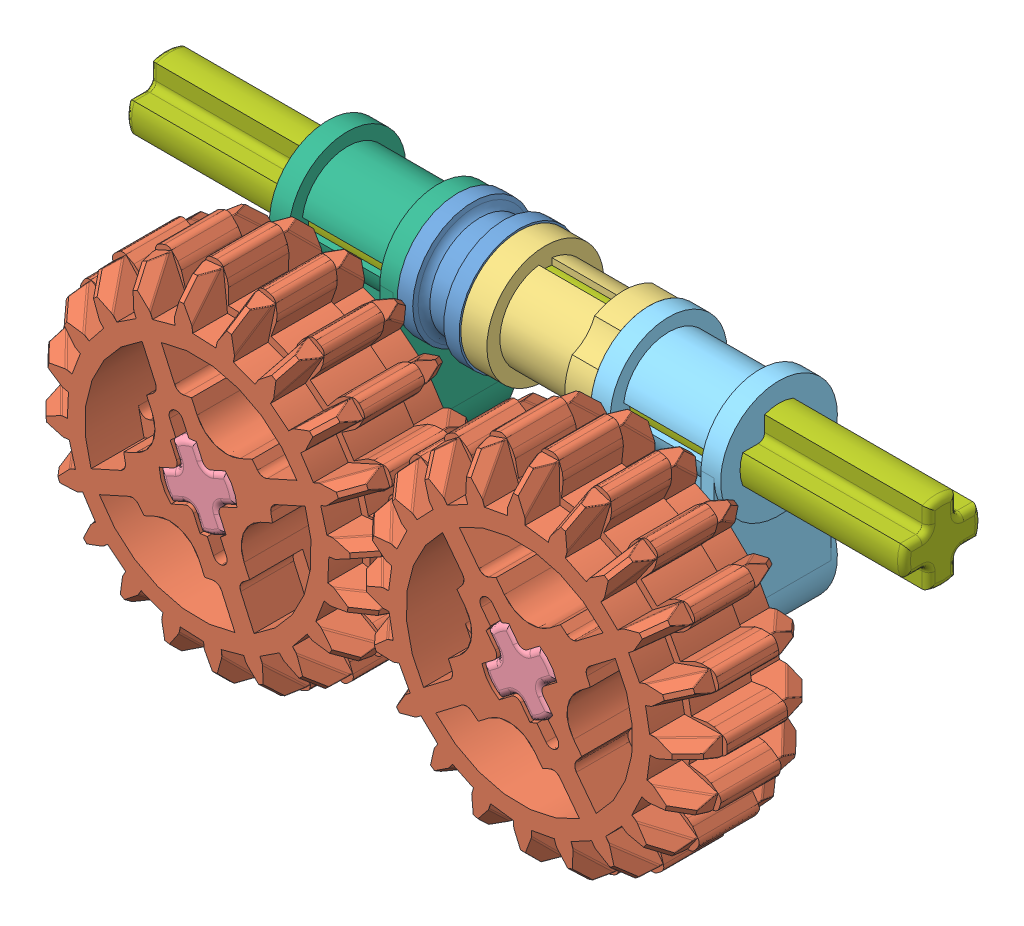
SolidWorks assembly 13.1.SLDASM, configuration Default (file format 12000). Lengths in mm.
Overall size (48.86 29.9 16.06).
9 component instances, 7 part files, 23 mates.
Components (placement in the parent):
- 32123 Bush 0.5 Smooth-1: 32123 Bush 0.5 Smooth.SLDPRT [Default] at (49.0234 -15.3474 45.225) x (1 0 0) z (0 1 0) size (4 7.44 7.44)
- 32269 Gear 20 Tooth Double Bevel Gray-1: 32269 Gear 20 Tooth Double Bevel Gray.SLDPRT [Default] at (62.9234 -23.3474 53.225) x (0.794952 0.606673 0) z (0.606673 -0.794952 0) size (21.33 8.11 21.33)
- 3713 Bush-1: 3713 Bush.SLDPRT [Default] at (54.9234 -15.3474 45.225) x (0 0 1) z (0 1 0) size (7.2 8 7.2)
- 3749 Axle Pin without Friction Ridges Lengthwise-1: 3749 Axle Pin without Friction Ridges Lengthwise.SLDPRT [Default] at (62.9234 -23.3474 49.225) x (0.606673 -0.794952 0) z (-0.794952 -0.606673 0) size (6 16 6)
- 3749 Axle Pin without Friction Ridges Lengthwise-2: 3749 Axle Pin without Friction Ridges Lengthwise.SLDPRT [Default] at (43.1234 -23.3474 49.225) x (-0.411303 0.911499 0) z (0.911499 0.411303 0) size (6 16 6)
- 32269 Gear 20 Tooth Double Bevel Gray-2: 32269 Gear 20 Tooth Double Bevel Gray.SLDPRT [Default] at (43.1234 -23.3474 53.225) x (0.911499 0.411303 0) z (0.411303 -0.911499 0) size (21.33 8.11 21.33)
- 6536 Axle and Pin Connector Perpendicular Blue-2: 6536 Axle and Pin Connector Perpendicular Blue.SLDPRT [Default] at (62.9234 -15.3474 45.225) x (0 1 0) z (0 0 -1) size (15.2 8 8)
- 6536 Axle and Pin Connector Perpendicular Red-2: 6536 Axle and Pin Connector Perpendicular Red.SLDPRT [Default] at (43.1234 -15.3474 45.225) x (0 1 0) z (0 0 -1) size (15.2 8 8)
- 3706 Axle 6-2: 3706 Axle 6.SLDPRT [Default] at (29.0234 -15.3474 45.225) x (0 0 -1) z (0 -1 0) size (4.8 48 4.8)
Mates (geometry in assembly coordinates):
- Concentric2: concentric anti-aligned: cylinder of 32123 Bush 0.5 Smooth-1 through (47.0071 -15.3474 45.225) axis (1 0 0) radius 2.4; cylinder of 3706 Axle 6-2 through (77.0234 -15.3474 45.225) axis (-1 0 0) radius 2.4
- Concentric3: concentric anti-aligned: cylinder of 3713 Bush-1 through (50.9234 -15.3474 45.225) axis (1 0 0) radius 2.4; cylinder of 3706 Axle 6-2 through (77.0234 -15.3474 45.225) axis (-1 0 0) radius 2.4
- Coincident1: coincident anti-aligned: plane of 32123 Bush 0.5 Smooth-1 through (50.9234 -15.3474 45.225) normal (1 0 0); plane of 3713 Bush-1 through (50.9234 -15.3474 45.225) normal (-1 0 0)
- Concentric4: concentric anti-aligned: cylinder of 6536 Axle and Pin Connector Perpendicular Red-2 through (39.1234 -15.3474 45.225) axis (1 0 0) radius 2.4; cylinder of 3706 Axle 6-2 through (77.0234 -15.3474 45.225) axis (-1 0 0) radius 2.4
- Coincident2: coincident anti-aligned: plane of 32123 Bush 0.5 Smooth-1 through (47.1234 -15.3474 45.225) normal (-1 0 0); plane of 6536 Axle and Pin Connector Perpendicular Red-2 through (47.1234 -15.3474 45.225) normal (1 0 0)
- Concentric5: concentric anti-aligned: cylinder of 6536 Axle and Pin Connector Perpendicular Blue-2 through (58.9234 -15.3474 45.225) axis (1 0 0) radius 2.4; cylinder of 3706 Axle 6-2 through (77.0234 -15.3474 45.225) axis (-1 0 0) radius 2.4
- Coincident3: coincident anti-aligned: plane of 3713 Bush-1 through (58.9234 -15.3474 45.225) normal (1 0 0); plane of 6536 Axle and Pin Connector Perpendicular Blue-2 through (58.9234 -15.3474 45.225) normal (-1 0 0)
- Coincident4: coincident anti-aligned: plane of 6536 Axle and Pin Connector Perpendicular Red-2 through (39.1234 -13.1146 46.105) normal (0 0 -1); plane of 3706 Axle 6-2 through (77.0234 -13.1146 46.105) normal (0 0 1)
- Coincident5: coincident: plane of 6536 Axle and Pin Connector Perpendicular Blue-2 through (58.9234 -16.2274 47.4579) normal (0 1 0); line of 3706 Axle 6-2 through (76.6234 -16.2274 46.505) axis (0 0 1)
- Concentric6: concentric anti-aligned: cylinder of 3749 Axle Pin without Friction Ridges Lengthwise-2 through (43.1234 -23.3474 41.225) axis (0 0 1) radius 2.4; cylinder of 6536 Axle and Pin Connector Perpendicular Red-2 through (43.1234 -23.3474 49.225) axis (0 0 -1) radius 2.4
- Coincident6: coincident anti-aligned: plane of 3749 Axle Pin without Friction Ridges Lengthwise-2 through (43.1234 -23.3474 48.425) normal (0 0 -1); plane of 6536 Axle and Pin Connector Perpendicular Red-2 through (43.1234 -23.3474 48.425) normal (0 0 1)
- Concentric7: concentric anti-aligned: cylinder of 3749 Axle Pin without Friction Ridges Lengthwise-1 through (62.9234 -23.3474 41.225) axis (0 0 1) radius 2.4; cylinder of 6536 Axle and Pin Connector Perpendicular Blue-2 through (62.9234 -23.3474 49.225) axis (0 0 -1) radius 2.4
- Coincident7: coincident anti-aligned: plane of 3749 Axle Pin without Friction Ridges Lengthwise-1 through (62.9234 -23.3474 48.425) normal (0 0 -1); plane of 6536 Axle and Pin Connector Perpendicular Blue-2 through (62.9234 -23.3474 48.425) normal (0 0 1)
- Concentric8: concentric anti-aligned: cylinder of 3749 Axle Pin without Friction Ridges Lengthwise-2 through (43.1234 -23.3474 57.225) axis (0 0 -1) radius 2.4; cylinder of 32269 Gear 20 Tooth Double Bevel Gray-2 through (43.1234 -23.3474 49.1701) axis (0 0 1) radius 2.4
- Coincident8: coincident anti-aligned: plane of 3749 Axle Pin without Friction Ridges Lengthwise-2 through (41.8323 -24.211 57.225) normal (-0.929047 0.369963 0); plane of 32269 Gear 20 Tooth Double Bevel Gray-2 through (43.1319 -20.9474 49.1701) normal (0.929047 -0.369963 0)
- Coincident9: coincident anti-aligned: plane of 32269 Gear 20 Tooth Double Bevel Gray-2 through (43.1234 -23.3474 49.225) normal (0 0 -1); plane of 6536 Axle and Pin Connector Perpendicular Red-2 through (43.1234 -23.3474 49.225) normal (0 0 1)
- Concentric9: concentric anti-aligned: cylinder of 32269 Gear 20 Tooth Double Bevel Gray-1 through (62.9234 -23.3474 49.1701) axis (0 0 1) radius 2.4; cylinder of 3749 Axle Pin without Friction Ridges Lengthwise-1 through (62.9234 -23.3474 57.225) axis (0 0 -1) radius 2.4
- Coincident10: coincident anti-aligned: plane of 32269 Gear 20 Tooth Double Bevel Gray-1 through (65.2431 -22.7319 49.1701) normal (-0.115816 -0.993271 0); plane of 3749 Axle Pin without Friction Ridges Lengthwise-1 through (61.7539 -22.3251 57.225) normal (0.115816 0.993271 0)
- Coincident11: coincident anti-aligned: plane of 32269 Gear 20 Tooth Double Bevel Gray-1 through (62.9234 -23.3474 49.225) normal (0 0 -1); plane of 3749 Axle Pin without Friction Ridges Lengthwise-1 through (62.9234 -23.3474 49.225) normal (0 0 1)
- Coincident12: coincident anti-aligned: plane of 3713 Bush-1 through (50.9234 -14.4674 46.505) normal (0 -1 0); plane of 3706 Axle 6-2 through (77.0234 -14.4674 47.4579) normal (0 1 0)
- Coincident13: coincident anti-aligned: plane of 32123 Bush 0.5 Smooth-1 through (47.0071 -14.4674 46.505) normal (0 -1 0); plane of 3706 Axle 6-2 through (77.0234 -14.4674 47.4579) normal (0 1 0)
- Distance1: distance = 10.1 mm aligned: plane of 6536 Axle and Pin Connector Perpendicular Blue-2 through (66.9234 -15.3474 45.225) normal (1 0 0); plane of 3706 Axle 6-2 through (77.0234 -15.3474 45.225) normal (1 0 0)
- GearMate1: gear = 16.13 mm: circle of 32269 Gear 20 Tooth Double Bevel Gray-2; circle of 32269 Gear 20 Tooth Double Bevel Gray-1
